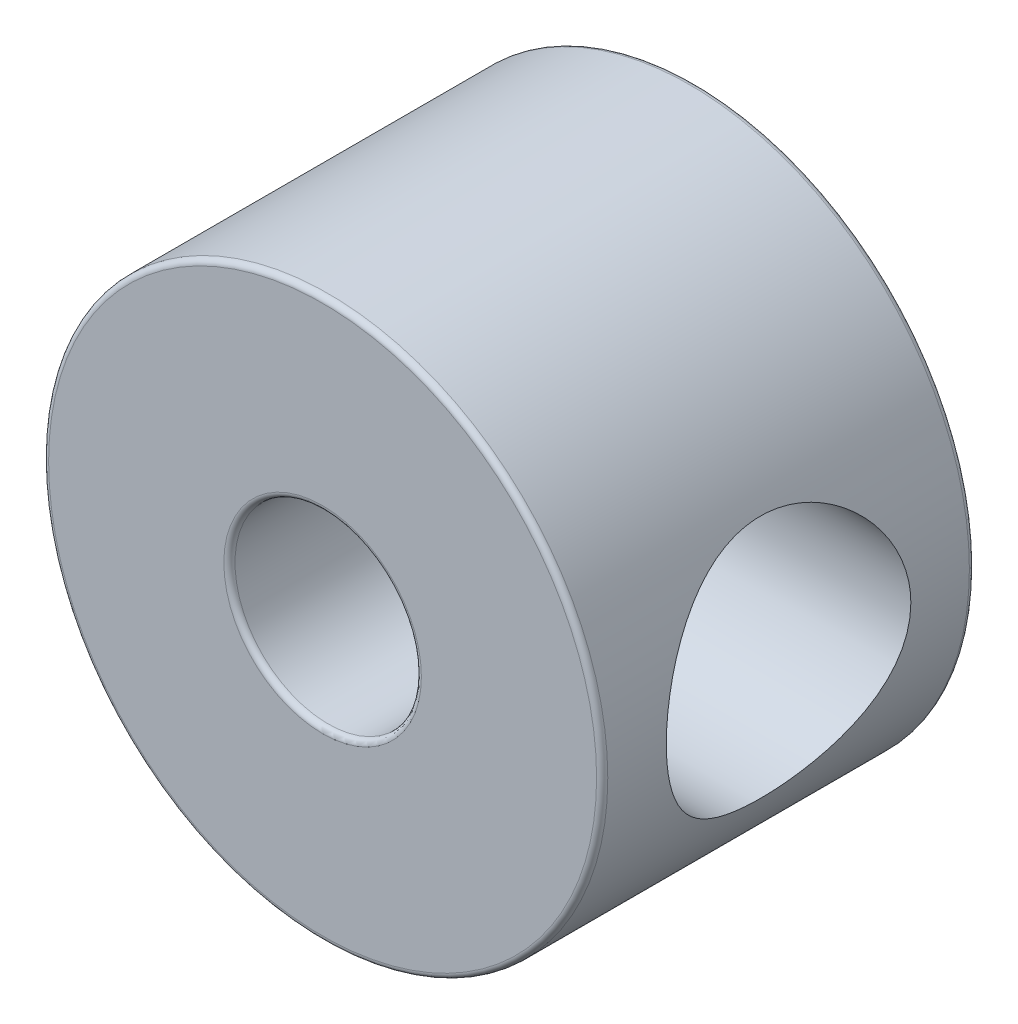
ISO-10303-21;
HEADER;
FILE_DESCRIPTION(('STEP AP214'),'2;1');
FILE_NAME('part.step','',(''),(''),'','','');
FILE_SCHEMA(('AUTOMOTIVE_DESIGN { 1 0 10303 214 1 1 1 1 }'));
ENDSEC;
DATA;
#1=APPLICATION_CONTEXT('core data for automotive mechanical design processes');
#2=APPLICATION_PROTOCOL_DEFINITION('international standard','automotive_design',2000,#1);
#3=PRODUCT_CONTEXT('',#1,'mechanical');
#4=PRODUCT('Part','Part','',(#3));
#5=PRODUCT_RELATED_PRODUCT_CATEGORY('part','',(#4));
#6=PRODUCT_DEFINITION_FORMATION('','',#4);
#7=PRODUCT_DEFINITION_CONTEXT('part definition',#1,'design');
#8=PRODUCT_DEFINITION('design','',#6,#7);
#9=PRODUCT_DEFINITION_SHAPE('','',#8);
#10=(LENGTH_UNIT() NAMED_UNIT(*) SI_UNIT(.MILLI.,.METRE.));
#11=(NAMED_UNIT(*) PLANE_ANGLE_UNIT() SI_UNIT($,.RADIAN.));
#12=(NAMED_UNIT(*) SI_UNIT($,.STERADIAN.) SOLID_ANGLE_UNIT());
#13=UNCERTAINTY_MEASURE_WITH_UNIT(LENGTH_MEASURE(1.E-05),#10,'distance_accuracy_value','');
#14=(GEOMETRIC_REPRESENTATION_CONTEXT(3) GLOBAL_UNCERTAINTY_ASSIGNED_CONTEXT((#13)) GLOBAL_UNIT_ASSIGNED_CONTEXT((#10,
#11,#12)) REPRESENTATION_CONTEXT('',''));
#15=CARTESIAN_POINT('',(0.,0.,0.));
#16=DIRECTION('',(0.,0.,1.));
#17=DIRECTION('',(1.,0.,0.));
#18=AXIS2_PLACEMENT_3D('',#15,#16,#17);
#19=CARTESIAN_POINT('',(1.11022302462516E-13,1.77635683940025E-12,6.35000000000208));
#20=DIRECTION('',(0.,0.,-0.999999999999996));
#21=DIRECTION('',(-1.,0.,0.));
#22=AXIS2_PLACEMENT_3D('',#19,#20,#21);
#23=CYLINDRICAL_SURFACE('',#22,1.58750000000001);
#24=CARTESIAN_POINT('',(-3.33066907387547E-13,8.88178419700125E-13,0.0952500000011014));
#25=DIRECTION('',(0.,0.,0.999999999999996));
#26=DIRECTION('',(1.,0.,0.));
#27=AXIS2_PLACEMENT_3D('',#24,#25,#26);
#28=CIRCLE('',#27,1.58750000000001);
#29=CARTESIAN_POINT('',(1.58749999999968,8.87980140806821E-13,0.0952500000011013));
#30=VERTEX_POINT('',#29);
#31=EDGE_CURVE('E98',#30,#30,#28,.F.);
#32=ORIENTED_EDGE('',*,*,#31,.T.);
#33=EDGE_LOOP('',(#32));
#34=FACE_BOUND('',#33,.T.);
#35=CARTESIAN_POINT('',(-1.11022302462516E-13,-8.88178419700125E-13,6.25475000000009));
#36=DIRECTION('',(0.,0.,0.999999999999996));
#37=DIRECTION('',(1.,0.,0.));
#38=AXIS2_PLACEMENT_3D('',#35,#36,#37);
#39=CIRCLE('',#38,1.58750000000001);
#40=CARTESIAN_POINT('',(1.5874999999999,-8.88376698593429E-13,6.25475000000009));
#41=VERTEX_POINT('',#40);
#42=EDGE_CURVE('E95',#41,#41,#39,.T.);
#43=ORIENTED_EDGE('',*,*,#42,.T.);
#44=EDGE_LOOP('',(#43));
#45=FACE_BOUND('',#44,.T.);
#46=CARTESIAN_POINT('',(-5.55111512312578E-13,-1.58749999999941,4.52329506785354));
#47=CARTESIAN_POINT('',(0.0371796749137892,-1.58751250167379,4.52326321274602));
#48=CARTESIAN_POINT('',(0.0743368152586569,-1.58619448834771,4.52483214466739));
#49=CARTESIAN_POINT('',(0.14814307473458,-1.5810010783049,4.53092016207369));
#50=CARTESIAN_POINT('',(0.184793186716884,-1.577131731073,4.53543226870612));
#51=CARTESIAN_POINT('',(0.256789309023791,-1.56701045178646,4.54707453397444));
#52=CARTESIAN_POINT('',(0.292146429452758,-1.56079296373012,4.55416679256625));
#53=CARTESIAN_POINT('',(0.361866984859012,-1.54611731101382,4.57060020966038));
#54=CARTESIAN_POINT('',(0.396229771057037,-1.53765771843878,4.57994280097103));
#55=CARTESIAN_POINT('',(0.512154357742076,-1.50503567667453,4.61516352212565));
#56=CARTESIAN_POINT('',(0.590930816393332,-1.47571907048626,4.64558051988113));
#57=CARTESIAN_POINT('',(0.741289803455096,-1.40626180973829,4.71214447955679));
#58=CARTESIAN_POINT('',(0.812826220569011,-1.36605712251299,4.74832479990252));
#59=CARTESIAN_POINT('',(0.949831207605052,-1.27471294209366,4.82325226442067));
#60=CARTESIAN_POINT('',(1.01512888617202,-1.22334959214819,4.86203865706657));
#61=CARTESIAN_POINT('',(1.13724834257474,-1.11072352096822,4.9382259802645));
#62=CARTESIAN_POINT('',(1.19408507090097,-1.049478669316,4.97562926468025));
#63=CARTESIAN_POINT('',(1.29617705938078,-0.920098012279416,5.04492936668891));
#64=CARTESIAN_POINT('',(1.34181694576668,-0.852356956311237,5.07699094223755));
#65=CARTESIAN_POINT('',(1.42294443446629,-0.708642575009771,5.13506859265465));
#66=CARTESIAN_POINT('',(1.45843945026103,-0.632675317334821,5.16108907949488));
#67=CARTESIAN_POINT('',(1.51306682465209,-0.48577632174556,5.20157068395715));
#68=CARTESIAN_POINT('',(1.53384789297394,-0.415776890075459,5.2171756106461));
#69=CARTESIAN_POINT('',(1.56567282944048,-0.27240644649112,5.24118501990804));
#70=CARTESIAN_POINT('',(1.57672316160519,-0.199037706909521,5.24959428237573));
#71=CARTESIAN_POINT('',(1.58843334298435,-0.0507808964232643,5.25850793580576));
#72=CARTESIAN_POINT('',(1.58906450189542,0.0241108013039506,5.25899049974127));
#73=CARTESIAN_POINT('',(1.57981967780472,0.172861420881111,5.25194993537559));
#74=CARTESIAN_POINT('',(1.56994201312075,0.246720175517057,5.24442552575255));
#75=CARTESIAN_POINT('',(1.54091140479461,0.38827938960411,5.22249165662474));
#76=CARTESIAN_POINT('',(1.52215233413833,0.45610814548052,5.20837488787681));
#77=CARTESIAN_POINT('',(1.47646448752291,0.587406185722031,5.17440346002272));
#78=CARTESIAN_POINT('',(1.44953370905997,0.650874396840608,5.1545473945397));
#79=CARTESIAN_POINT('',(1.38527569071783,0.778997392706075,5.10796296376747));
#80=CARTESIAN_POINT('',(1.34714863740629,0.843063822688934,5.08072902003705));
#81=CARTESIAN_POINT('',(1.26335095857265,0.964120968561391,5.02244383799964));
#82=CARTESIAN_POINT('',(1.21767534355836,1.02110696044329,4.9913900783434));
#83=CARTESIAN_POINT('',(1.10989755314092,1.13834676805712,4.9207911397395));
#84=CARTESIAN_POINT('',(1.04633627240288,1.19698345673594,4.88078807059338));
#85=CARTESIAN_POINT('',(0.910405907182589,1.30337353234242,4.80094395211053));
#86=CARTESIAN_POINT('',(0.83802511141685,1.3511122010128,4.76110319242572));
#87=CARTESIAN_POINT('',(0.69842674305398,1.42741004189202,4.69246534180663));
#88=CARTESIAN_POINT('',(0.632598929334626,1.45787222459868,4.66296717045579));
#89=CARTESIAN_POINT('',(0.49552149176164,1.50995014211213,4.61008838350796));
#90=CARTESIAN_POINT('',(0.424302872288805,1.53161249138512,4.58667577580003));
#91=CARTESIAN_POINT('',(0.29455780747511,1.56099054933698,4.55403370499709));
#92=CARTESIAN_POINT('',(0.237043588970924,1.57079832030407,4.54275500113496));
#93=CARTESIAN_POINT('',(0.14923668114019,1.58074899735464,4.5312128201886));
#94=CARTESIAN_POINT('',(0.119547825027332,1.58327288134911,4.52826030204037));
#95=CARTESIAN_POINT('',(0.059911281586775,1.58665131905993,4.5242947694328));
#96=CARTESIAN_POINT('',(0.0299633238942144,1.58750384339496,4.52328411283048));
#97=CARTESIAN_POINT('',(0.,1.5875000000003,4.52329506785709));
#98=B_SPLINE_CURVE_WITH_KNOTS('',3,(#46,#47,#48,#49,#50,#51,#52,#53,#54,#55,#56,#57,#58,#59,#60,
#61,#62,#63,#64,#65,#66,#67,#68,#69,#70,#71,#72,#73,#74,#75,#76,#77,#78,#79,#80,#81,#82,#83,#84,
#85,#86,#87,#88,#89,#90,#91,#92,#93,#94,#95,#96,#97),.UNSPECIFIED.,.F.,.F.,(4,2,2,2,2,2,2,2,2,2,
2,2,2,2,2,2,2,2,2,2,2,2,2,2,2,4),(0.,0.111446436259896,0.222629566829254,0.332241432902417,
0.441923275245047,0.708474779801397,0.976629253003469,1.25076368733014,1.52440782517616,
1.78662051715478,2.04864110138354,2.2716794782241,2.49456958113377,2.71807333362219,
2.94161285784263,3.15605417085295,3.37054807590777,3.60779585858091,3.84520109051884,
4.1299808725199,4.41514301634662,4.64933235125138,4.88226443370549,5.05977123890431,
5.14949546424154,5.23932856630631),.UNSPECIFIED.);
#99=CARTESIAN_POINT('',(-5.55111512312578E-13,-1.58749999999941,4.52329506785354));
#100=VERTEX_POINT('',#99);
#101=CARTESIAN_POINT('',(0.,1.5875000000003,4.52329506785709));
#102=VERTEX_POINT('',#101);
#103=EDGE_CURVE('E73',#100,#102,#98,.T.);
#104=ORIENTED_EDGE('',*,*,#103,.F.);
#105=DIRECTION('',(0.,0.,-0.999999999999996));
#106=VECTOR('',#105,1.);
#107=CARTESIAN_POINT('',(1.11022302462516E-13,-1.58750000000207,6.34999999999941));
#108=LINE('',#107,#106);
#109=CARTESIAN_POINT('',(-2.22044604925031E-13,-1.5875000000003,1.82670493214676));
#110=VERTEX_POINT('',#109);
#111=EDGE_CURVE('E77',#100,#110,#108,.T.);
#112=ORIENTED_EDGE('',*,*,#111,.T.);
#113=CARTESIAN_POINT('',(1.11022302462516E-13,1.58749999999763,1.82670493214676));
#114=CARTESIAN_POINT('',(0.0371796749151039,1.58751250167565,1.82673678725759));
#115=CARTESIAN_POINT('',(0.0743368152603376,1.58619448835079,1.82516785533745));
#116=CARTESIAN_POINT('',(0.148143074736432,1.58100107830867,1.81907983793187));
#117=CARTESIAN_POINT('',(0.184793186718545,1.57713173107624,1.81456773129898));
#118=CARTESIAN_POINT('',(0.256789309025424,1.56701045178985,1.80292546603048));
#119=CARTESIAN_POINT('',(0.292146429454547,1.56079296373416,1.79583320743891));
#120=CARTESIAN_POINT('',(0.361866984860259,1.54611731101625,1.77939979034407));
#121=CARTESIAN_POINT('',(0.39622977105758,1.53765771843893,1.77005719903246));
#122=CARTESIAN_POINT('',(0.512154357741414,1.50503567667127,1.73483647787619));
#123=CARTESIAN_POINT('',(0.590930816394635,1.47571907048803,1.70441948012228));
#124=CARTESIAN_POINT('',(0.741289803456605,1.40626180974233,1.63785552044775));
#125=CARTESIAN_POINT('',(0.812826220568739,1.36605712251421,1.60167520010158));
#126=CARTESIAN_POINT('',(0.949831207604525,1.274712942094,1.52674773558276));
#127=CARTESIAN_POINT('',(1.01512888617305,1.22334959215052,1.48796134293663));
#128=CARTESIAN_POINT('',(1.13724834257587,1.110723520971,1.41177401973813));
#129=CARTESIAN_POINT('',(1.19408507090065,1.04947866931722,1.37437073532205));
#130=CARTESIAN_POINT('',(1.29617705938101,0.920098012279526,1.3050706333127));
#131=CARTESIAN_POINT('',(1.34181694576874,0.852356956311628,1.27300905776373));
#132=CARTESIAN_POINT('',(1.42294443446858,0.708642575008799,1.21493140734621));
#133=CARTESIAN_POINT('',(1.45843945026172,0.632675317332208,1.1889109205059));
#134=CARTESIAN_POINT('',(1.51306682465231,0.485776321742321,1.14842931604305));
#135=CARTESIAN_POINT('',(1.53384789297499,0.415776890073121,1.13282438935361));
#136=CARTESIAN_POINT('',(1.56567282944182,0.272406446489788,1.10881498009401));
#137=CARTESIAN_POINT('',(1.57672316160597,0.199037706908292,1.10040571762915));
#138=CARTESIAN_POINT('',(1.58843334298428,0.0507808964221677,1.09149206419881));
#139=CARTESIAN_POINT('',(1.58906450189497,-0.0241108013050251,1.09100950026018));
#140=CARTESIAN_POINT('',(1.5798196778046,-0.172861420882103,1.09805006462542));
#141=CARTESIAN_POINT('',(1.56994201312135,-0.24672017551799,1.10557447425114));
#142=CARTESIAN_POINT('',(1.54091140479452,-0.388279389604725,1.12750834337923));
#143=CARTESIAN_POINT('',(1.52215233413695,-0.456108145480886,1.14162511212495));
#144=CARTESIAN_POINT('',(1.47646448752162,-0.587406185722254,1.17559653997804));
#145=CARTESIAN_POINT('',(1.44953370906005,-0.650874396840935,1.19545260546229));
#146=CARTESIAN_POINT('',(1.38527569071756,-0.778997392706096,1.24203703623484));
#147=CARTESIAN_POINT('',(1.34714863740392,-0.843063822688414,1.26927097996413));
#148=CARTESIAN_POINT('',(1.26335095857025,-0.964120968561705,1.32755616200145));
#149=CARTESIAN_POINT('',(1.21767534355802,-1.021106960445,1.35860992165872));
#150=CARTESIAN_POINT('',(1.10989755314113,-1.1383467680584,1.42920886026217));
#151=CARTESIAN_POINT('',(1.04633627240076,-1.19698345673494,1.46921192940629));
#152=CARTESIAN_POINT('',(0.910405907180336,-1.30337353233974,1.54905604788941));
#153=CARTESIAN_POINT('',(0.838025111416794,-1.35111220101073,1.58889680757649));
#154=CARTESIAN_POINT('',(0.698426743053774,-1.42741004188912,1.65753465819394));
#155=CARTESIAN_POINT('',(0.632598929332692,-1.45787222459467,1.68703282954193));
#156=CARTESIAN_POINT('',(0.495521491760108,-1.50995014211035,1.73991161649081));
#157=CARTESIAN_POINT('',(0.424302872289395,-1.53161249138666,1.76332422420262));
#158=CARTESIAN_POINT('',(0.294557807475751,-1.56099054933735,1.79596629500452));
#159=CARTESIAN_POINT('',(0.237043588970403,-1.57079832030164,1.80724499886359));
#160=CARTESIAN_POINT('',(0.149236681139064,-1.58074899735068,1.81878717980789));
#161=CARTESIAN_POINT('',(0.119547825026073,-1.5832728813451,1.82173969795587));
#162=CARTESIAN_POINT('',(0.0599112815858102,-1.58665131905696,1.82570523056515));
#163=CARTESIAN_POINT('',(0.0299633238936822,-1.5875038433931,1.82671588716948));
#164=CARTESIAN_POINT('',(-2.22044604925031E-13,-1.5875000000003,1.82670493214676));
#165=B_SPLINE_CURVE_WITH_KNOTS('',3,(#113,#114,#115,#116,#117,#118,#119,#120,#121,#122,#123,
#124,#125,#126,#127,#128,#129,#130,#131,#132,#133,#134,#135,#136,#137,#138,#139,#140,#141,#142,
#143,#144,#145,#146,#147,#148,#149,#150,#151,#152,#153,#154,#155,#156,#157,#158,#159,#160,#161,
#162,#163,#164),.UNSPECIFIED.,.F.,.F.,(4,2,2,2,2,2,2,2,2,2,2,2,2,2,2,2,2,2,2,2,2,2,2,2,2,4),(0.,
0.111446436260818,0.222629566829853,0.332241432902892,0.441923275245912,0.708474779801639,
0.976629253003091,1.25076368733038,1.52440782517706,1.78662051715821,2.0486411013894,
2.27167947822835,2.49456958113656,2.71807333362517,2.94161285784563,3.15605417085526,
3.37054807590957,3.60779585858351,3.84520109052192,4.12998087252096,4.41514301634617,
4.64933235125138,4.88226443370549,5.05977123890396,5.14949546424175,5.23932856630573),.UNSPECIFIED.);
#166=CARTESIAN_POINT('',(1.11022302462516E-13,1.58749999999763,1.82670493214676));
#167=VERTEX_POINT('',#166);
#168=EDGE_CURVE('E65',#167,#110,#165,.T.);
#169=ORIENTED_EDGE('',*,*,#168,.F.);
#170=DIRECTION('',(0.,0.,-0.999999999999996));
#171=VECTOR('',#170,1.);
#172=CARTESIAN_POINT('',(3.33066907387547E-13,1.58749999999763,6.35000000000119));
#173=LINE('',#172,#171);
#174=EDGE_CURVE('E56',#167,#102,#173,.F.);
#175=ORIENTED_EDGE('',*,*,#174,.T.);
#176=EDGE_LOOP('',(#104,#112,#169,#175));
#177=FACE_BOUND('',#176,.T.);
#178=ADVANCED_FACE('F38',(#34,#45,#177),#23,.F.);
#179=CARTESIAN_POINT('',(1.11022302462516E-13,1.77635683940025E-12,6.35000000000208));
#180=DIRECTION('',(0.,0.,0.999999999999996));
#181=DIRECTION('',(1.,0.,0.));
#182=AXIS2_PLACEMENT_3D('',#179,#180,#181);
#183=PLANE('',#182);
#184=CARTESIAN_POINT('',(1.11022302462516E-13,1.77635683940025E-12,6.35000000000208));
#185=DIRECTION('',(0.,0.,0.999999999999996));
#186=DIRECTION('',(1.,0.,0.));
#187=AXIS2_PLACEMENT_3D('',#184,#185,#186);
#188=CIRCLE('',#187,1.68275000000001);
#189=CARTESIAN_POINT('',(1.68275000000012,1.77614666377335E-12,6.35000000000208));
#190=VERTEX_POINT('',#189);
#191=EDGE_CURVE('E104',#190,#190,#188,.F.);
#192=ORIENTED_EDGE('',*,*,#191,.T.);
#193=EDGE_LOOP('',(#192));
#194=FACE_BOUND('',#193,.T.);
#195=CARTESIAN_POINT('',(1.11022302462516E-13,1.77635683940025E-12,6.35000000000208));
#196=DIRECTION('',(0.,0.,0.999999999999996));
#197=DIRECTION('',(1.,0.,0.));
#198=AXIS2_PLACEMENT_3D('',#195,#196,#197);
#199=CIRCLE('',#198,4.66725);
#200=CARTESIAN_POINT('',(4.66725000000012,1.77577389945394E-12,6.35000000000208));
#201=VERTEX_POINT('',#200);
#202=EDGE_CURVE('E101',#201,#201,#199,.T.);
#203=ORIENTED_EDGE('',*,*,#202,.T.);
#204=EDGE_LOOP('',(#203));
#205=FACE_BOUND('',#204,.T.);
#206=ADVANCED_FACE('F117',(#194,#205),#183,.T.);
#207=CARTESIAN_POINT('',(0.,0.,0.));
#208=DIRECTION('',(0.,0.,0.999999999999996));
#209=DIRECTION('',(1.,0.,0.));
#210=AXIS2_PLACEMENT_3D('',#207,#208,#209);
#211=PLANE('',#210);
#212=CARTESIAN_POINT('',(0.,0.,0.));
#213=DIRECTION('',(0.,0.,0.999999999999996));
#214=DIRECTION('',(1.,0.,0.));
#215=AXIS2_PLACEMENT_3D('',#212,#213,#214);
#216=CIRCLE('',#215,1.68275000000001);
#217=CARTESIAN_POINT('',(1.68275000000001,0.,0.));
#218=VERTEX_POINT('',#217);
#219=EDGE_CURVE('E83',#218,#218,#216,.T.);
#220=ORIENTED_EDGE('',*,*,#219,.T.);
#221=EDGE_LOOP('',(#220));
#222=FACE_BOUND('',#221,.T.);
#223=CARTESIAN_POINT('',(0.,0.,0.));
#224=DIRECTION('',(0.,0.,0.999999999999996));
#225=DIRECTION('',(1.,0.,0.));
#226=AXIS2_PLACEMENT_3D('',#223,#224,#225);
#227=CIRCLE('',#226,4.66725);
#228=CARTESIAN_POINT('',(4.66725000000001,0.,0.));
#229=VERTEX_POINT('',#228);
#230=EDGE_CURVE('E80',#229,#229,#227,.F.);
#231=ORIENTED_EDGE('',*,*,#230,.T.);
#232=EDGE_LOOP('',(#231));
#233=FACE_BOUND('',#232,.T.);
#234=ADVANCED_FACE('F119',(#222,#233),#211,.F.);
#235=CARTESIAN_POINT('',(1.11022302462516E-13,1.77635683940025E-12,6.35000000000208));
#236=DIRECTION('',(0.,0.,-0.999999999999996));
#237=DIRECTION('',(-1.,0.,0.));
#238=AXIS2_PLACEMENT_3D('',#235,#236,#237);
#239=CYLINDRICAL_SURFACE('',#238,4.7625);
#240=CARTESIAN_POINT('',(-3.33066907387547E-13,8.88178419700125E-13,0.0952500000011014));
#241=DIRECTION('',(0.,0.,0.999999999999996));
#242=DIRECTION('',(1.,0.,0.));
#243=AXIS2_PLACEMENT_3D('',#240,#241,#242);
#244=CIRCLE('',#243,4.7625);
#245=CARTESIAN_POINT('',(4.76249999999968,8.87583583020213E-13,0.095250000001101));
#246=VERTEX_POINT('',#245);
#247=EDGE_CURVE('E11',#246,#246,#244,.T.);
#248=ORIENTED_EDGE('',*,*,#247,.T.);
#249=EDGE_LOOP('',(#248));
#250=FACE_BOUND('',#249,.T.);
#251=CARTESIAN_POINT('',(-1.11022302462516E-13,-8.88178419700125E-13,6.25475000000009));
#252=DIRECTION('',(0.,0.,0.999999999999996));
#253=DIRECTION('',(1.,0.,0.));
#254=AXIS2_PLACEMENT_3D('',#251,#252,#253);
#255=CIRCLE('',#254,4.7625);
#256=CARTESIAN_POINT('',(4.7624999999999,-8.88773256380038E-13,6.25475000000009));
#257=VERTEX_POINT('',#256);
#258=EDGE_CURVE('E46',#257,#257,#255,.F.);
#259=ORIENTED_EDGE('',*,*,#258,.T.);
#260=EDGE_LOOP('',(#259));
#261=FACE_BOUND('',#260,.T.);
#262=CARTESIAN_POINT('',(4.76250000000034,8.88178419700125E-13,1.09220000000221));
#263=CARTESIAN_POINT('',(4.76249603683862,-0.111071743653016,1.0922048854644));
#264=CARTESIAN_POINT('',(4.7585707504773,-0.222321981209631,1.1011371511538));
#265=CARTESIAN_POINT('',(4.74326014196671,-0.441632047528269,1.13651697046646));
#266=CARTESIAN_POINT('',(4.73185647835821,-0.549683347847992,1.16300758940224));
#267=CARTESIAN_POINT('',(4.70280170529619,-0.759075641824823,1.23232764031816));
#268=CARTESIAN_POINT('',(4.68517262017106,-0.860438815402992,1.27509951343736));
#269=CARTESIAN_POINT('',(4.64536073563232,-1.05444297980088,1.37551525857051));
#270=CARTESIAN_POINT('',(4.62317906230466,-1.14708611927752,1.43315545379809));
#271=CARTESIAN_POINT('',(4.57511002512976,-1.32619574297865,1.56496014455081));
#272=CARTESIAN_POINT('',(4.54909352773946,-1.41212894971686,1.6398017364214));
#273=CARTESIAN_POINT('',(4.49681211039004,-1.57069122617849,1.80244876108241));
#274=CARTESIAN_POINT('',(4.47054705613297,-1.64331261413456,1.89026162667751));
#275=CARTESIAN_POINT('',(4.41910049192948,-1.77718548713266,2.08224910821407));
#276=CARTESIAN_POINT('',(4.39405989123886,-1.83758288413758,2.18706109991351));
#277=CARTESIAN_POINT('',(4.34997330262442,-1.9396526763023,2.40660325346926));
#278=CARTESIAN_POINT('',(4.33092392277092,-1.98133567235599,2.52132775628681));
#279=CARTESIAN_POINT('',(4.30238873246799,-2.04253551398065,2.75130313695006));
#280=CARTESIAN_POINT('',(4.29246082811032,-2.06308358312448,2.86622247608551));
#281=CARTESIAN_POINT('',(4.28203712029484,-2.08463987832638,3.0982733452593));
#282=CARTESIAN_POINT('',(4.2815353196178,-2.08566052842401,3.2154034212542));
#283=CARTESIAN_POINT('',(4.28965031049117,-2.06890402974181,3.43776984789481));
#284=CARTESIAN_POINT('',(4.29748584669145,-2.05273752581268,3.54316206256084));
#285=CARTESIAN_POINT('',(4.32006087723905,-2.00478801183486,3.74955203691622));
#286=CARTESIAN_POINT('',(4.33480185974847,-1.97300163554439,3.85054884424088));
#287=CARTESIAN_POINT('',(4.3698670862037,-1.8940856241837,4.04795534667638));
#288=CARTESIAN_POINT('',(4.39030794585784,-1.84663122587,4.14421355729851));
#289=CARTESIAN_POINT('',(4.43444930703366,-1.73795862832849,4.32779938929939));
#290=CARTESIAN_POINT('',(4.45815115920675,-1.67673471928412,4.41512328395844));
#291=CARTESIAN_POINT('',(4.50885047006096,-1.53551529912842,4.58700269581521));
#292=CARTESIAN_POINT('',(4.53594828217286,-1.45429620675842,4.67052632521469));
#293=CARTESIAN_POINT('',(4.58852439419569,-1.27876496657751,4.82313395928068));
#294=CARTESIAN_POINT('',(4.61400223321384,-1.18444911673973,4.89221386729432));
#295=CARTESIAN_POINT('',(4.66135005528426,-0.981993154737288,5.01570142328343));
#296=CARTESIAN_POINT('',(4.68310019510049,-0.873541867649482,5.06964833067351));
#297=CARTESIAN_POINT('',(4.71960237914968,-0.647907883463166,5.15816213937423));
#298=CARTESIAN_POINT('',(4.73435869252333,-0.530730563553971,5.19274086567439));
#299=CARTESIAN_POINT('',(4.75438789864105,-0.299558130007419,5.23928227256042));
#300=CARTESIAN_POINT('',(4.76023920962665,-0.185891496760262,5.25262721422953));
#301=CARTESIAN_POINT('',(4.76367688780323,0.0422002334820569,5.2604937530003));
#302=CARTESIAN_POINT('',(4.76126594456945,0.156625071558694,5.2550214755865));
#303=CARTESIAN_POINT('',(4.7488191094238,0.37623950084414,5.22636058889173));
#304=CARTESIAN_POINT('',(4.73921662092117,0.481587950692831,5.20417857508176));
#305=CARTESIAN_POINT('',(4.71383524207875,0.686930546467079,5.14416956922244));
#306=CARTESIAN_POINT('',(4.69805559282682,0.786924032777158,5.10634065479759));
#307=CARTESIAN_POINT('',(4.66119752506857,0.982261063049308,5.01489504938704));
#308=CARTESIAN_POINT('',(4.63996894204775,1.07736167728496,4.96082197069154));
#309=CARTESIAN_POINT('',(4.59443017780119,1.25748262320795,4.83892084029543));
#310=CARTESIAN_POINT('',(4.5701186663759,1.34249857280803,4.77108684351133));
#311=CARTESIAN_POINT('',(4.51865251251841,1.50704626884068,4.61739782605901));
#312=CARTESIAN_POINT('',(4.49142426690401,1.58562810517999,4.53054792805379));
#313=CARTESIAN_POINT('',(4.4388289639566,1.72740709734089,4.34453050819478));
#314=CARTESIAN_POINT('',(4.41346250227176,1.79059934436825,4.24535907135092));
#315=CARTESIAN_POINT('',(4.36710736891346,1.90090710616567,4.03466919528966));
#316=CARTESIAN_POINT('',(4.34622137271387,1.94765867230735,3.92293587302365));
#317=CARTESIAN_POINT('',(4.31249652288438,2.02124915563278,3.69197284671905));
#318=CARTESIAN_POINT('',(4.29965011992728,2.04810675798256,3.57275029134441));
#319=CARTESIAN_POINT('',(4.28469192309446,2.07920462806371,3.34083228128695));
#320=CARTESIAN_POINT('',(4.28177887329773,2.08513454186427,3.22841452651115));
#321=CARTESIAN_POINT('',(4.28485257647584,2.07881197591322,3.00422807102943));
#322=CARTESIAN_POINT('',(4.29083758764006,2.06656305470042,2.89245924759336));
#323=CARTESIAN_POINT('',(4.31027001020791,2.02569515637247,2.67928372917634));
#324=CARTESIAN_POINT('',(4.32327719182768,1.99803909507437,2.57764822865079));
#325=CARTESIAN_POINT('',(4.35489989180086,1.92813811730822,2.38046245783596));
#326=CARTESIAN_POINT('',(4.37351701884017,1.88588901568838,2.28491394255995));
#327=CARTESIAN_POINT('',(4.41571713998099,1.78494166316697,2.09600788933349));
#328=CARTESIAN_POINT('',(4.43953957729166,1.72537274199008,2.00317025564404));
#329=CARTESIAN_POINT('',(4.48886909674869,1.59263020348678,1.82828257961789));
#330=CARTESIAN_POINT('',(4.51437685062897,1.51945114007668,1.74623687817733));
#331=CARTESIAN_POINT('',(4.56676110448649,1.35432770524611,1.58818661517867));
#332=CARTESIAN_POINT('',(4.59357384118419,1.26132618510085,1.51325994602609));
#333=CARTESIAN_POINT('',(4.64344986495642,1.06311311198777,1.37997779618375));
#334=CARTESIAN_POINT('',(4.66651144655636,0.957896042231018,1.32162984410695));
#335=CARTESIAN_POINT('',(4.7060481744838,0.739382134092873,1.22423130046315));
#336=CARTESIAN_POINT('',(4.72260425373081,0.626206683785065,1.18494205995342));
#337=CARTESIAN_POINT('',(4.74758674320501,0.394140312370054,1.12635570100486));
#338=CARTESIAN_POINT('',(4.75603812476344,0.275268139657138,1.10699716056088));
#339=CARTESIAN_POINT('',(4.76080263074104,0.129794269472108,1.09608454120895));
#340=CARTESIAN_POINT('',(4.76143809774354,0.103863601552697,1.09462913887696));
#341=CARTESIAN_POINT('',(4.76228724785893,0.0519585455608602,1.09268629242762));
#342=CARTESIAN_POINT('',(4.76250092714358,0.0259841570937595,1.09219885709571));
#343=CARTESIAN_POINT('',(4.76250000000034,8.88178419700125E-13,1.09220000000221));
#344=B_SPLINE_CURVE_WITH_KNOTS('',3,(#262,#263,#264,#265,#266,#267,#268,#269,#270,#271,#272,
#273,#274,#275,#276,#277,#278,#279,#280,#281,#282,#283,#284,#285,#286,#287,#288,#289,#290,#291,
#292,#293,#294,#295,#296,#297,#298,#299,#300,#301,#302,#303,#304,#305,#306,#307,#308,#309,#310,
#311,#312,#313,#314,#315,#316,#317,#318,#319,#320,#321,#322,#323,#324,#325,#326,#327,#328,#329,
#330,#331,#332,#333,#334,#335,#336,#337,#338,#339,#340,#341,#342,#343),.UNSPECIFIED.,.T.,.F.,(4,
2,2,2,2,2,2,2,2,2,2,2,2,2,2,2,2,2,2,2,2,2,2,2,2,2,2,2,2,2,2,2,2,2,2,2,2,2,2,2,4),(0.,
0.333108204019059,0.667036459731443,0.999794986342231,1.33247130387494,1.68162667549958,
2.03098290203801,2.3997170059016,2.76824197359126,3.11778335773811,3.46710234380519,
3.7863502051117,4.10566689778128,4.43206803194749,4.75860476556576,5.11583708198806,
5.47317058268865,5.84042760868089,6.20746016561,6.54944714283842,6.89132280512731,
7.21410342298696,7.53692370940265,7.86983121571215,8.20288285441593,8.5619995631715,
8.92123066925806,9.28797626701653,9.65437696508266,9.99041826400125,10.3263937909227,
10.6434074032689,10.96051200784,11.29765297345,11.6349291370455,12.0003920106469,
12.3660205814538,12.7269444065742,13.0867525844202,13.1646793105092,13.2426067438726),.UNSPECIFIED.);
#345=CARTESIAN_POINT('',(4.76250000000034,8.88178419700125E-13,1.09220000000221));
#346=VERTEX_POINT('',#345);
#347=EDGE_CURVE('E78',#346,#346,#344,.T.);
#348=ORIENTED_EDGE('',*,*,#347,.T.);
#349=EDGE_LOOP('',(#348));
#350=FACE_BOUND('',#349,.T.);
#351=ADVANCED_FACE('F109',(#250,#261,#350),#239,.T.);
#352=CARTESIAN_POINT('',(-5.89104801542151,0.,3.17500000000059));
#353=DIRECTION('',(1.,0.,0.));
#354=DIRECTION('',(0.,0.,-0.999999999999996));
#355=AXIS2_PLACEMENT_3D('',#352,#353,#354);
#356=CYLINDRICAL_SURFACE('',#355,2.0828);
#357=ORIENTED_EDGE('',*,*,#103,.T.);
#358=CARTESIAN_POINT('',(1.11022302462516E-13,1.77635683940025E-12,3.17500000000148));
#359=DIRECTION('',(1.,0.,0.));
#360=DIRECTION('',(0.,0.,-0.999999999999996));
#361=AXIS2_PLACEMENT_3D('',#358,#359,#360);
#362=CIRCLE('',#361,2.0828);
#363=EDGE_CURVE('E52',#102,#167,#362,.F.);
#364=ORIENTED_EDGE('',*,*,#363,.T.);
#365=ORIENTED_EDGE('',*,*,#168,.T.);
#366=EDGE_CURVE('E69',#110,#100,#362,.F.);
#367=ORIENTED_EDGE('',*,*,#366,.T.);
#368=EDGE_LOOP('',(#357,#364,#365,#367));
#369=FACE_BOUND('',#368,.T.);
#370=ORIENTED_EDGE('',*,*,#347,.F.);
#371=EDGE_LOOP('',(#370));
#372=FACE_BOUND('',#371,.T.);
#373=ADVANCED_FACE('F67',(#369,#372),#356,.F.);
#374=CARTESIAN_POINT('',(0.,0.,0.));
#375=DIRECTION('',(1.,0.,0.));
#376=DIRECTION('',(0.,0.,-0.999999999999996));
#377=AXIS2_PLACEMENT_3D('',#374,#375,#376);
#378=PLANE('',#377);
#379=ORIENTED_EDGE('',*,*,#366,.F.);
#380=ORIENTED_EDGE('',*,*,#111,.F.);
#381=EDGE_LOOP('',(#379,#380));
#382=FACE_BOUND('',#381,.T.);
#383=ADVANCED_FACE('F76',(#382),#378,.T.);
#384=ORIENTED_EDGE('',*,*,#363,.F.);
#385=ORIENTED_EDGE('',*,*,#174,.F.);
#386=EDGE_LOOP('',(#384,#385));
#387=FACE_BOUND('',#386,.T.);
#388=ADVANCED_FACE('F145',(#387),#378,.T.);
#389=CARTESIAN_POINT('',(-3.33066907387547E-13,8.88178419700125E-13,0.0952500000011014));
#390=DIRECTION('',(0.,0.,0.999999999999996));
#391=DIRECTION('',(1.,0.,0.));
#392=AXIS2_PLACEMENT_3D('',#389,#390,#391);
#393=TOROIDAL_SURFACE('',#392,1.68275000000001,0.09525);
#394=ORIENTED_EDGE('',*,*,#31,.F.);
#395=EDGE_LOOP('',(#394));
#396=FACE_BOUND('',#395,.T.);
#397=ORIENTED_EDGE('',*,*,#219,.F.);
#398=EDGE_LOOP('',(#397));
#399=FACE_BOUND('',#398,.T.);
#400=ADVANCED_FACE('F134',(#396,#399),#393,.T.);
#401=CARTESIAN_POINT('',(-1.11022302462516E-13,-8.88178419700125E-13,6.25475000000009));
#402=DIRECTION('',(0.,0.,0.999999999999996));
#403=DIRECTION('',(1.,0.,0.));
#404=AXIS2_PLACEMENT_3D('',#401,#402,#403);
#405=TOROIDAL_SURFACE('',#404,1.68275000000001,0.09525);
#406=ORIENTED_EDGE('',*,*,#191,.F.);
#407=EDGE_LOOP('',(#406));
#408=FACE_BOUND('',#407,.T.);
#409=ORIENTED_EDGE('',*,*,#42,.F.);
#410=EDGE_LOOP('',(#409));
#411=FACE_BOUND('',#410,.T.);
#412=ADVANCED_FACE('F159',(#408,#411),#405,.T.);
#413=CARTESIAN_POINT('',(-3.33066907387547E-13,8.88178419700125E-13,0.0952500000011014));
#414=DIRECTION('',(0.,0.,0.999999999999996));
#415=DIRECTION('',(1.,0.,0.));
#416=AXIS2_PLACEMENT_3D('',#413,#414,#415);
#417=TOROIDAL_SURFACE('',#416,4.66725,0.09525);
#418=ORIENTED_EDGE('',*,*,#230,.F.);
#419=EDGE_LOOP('',(#418));
#420=FACE_BOUND('',#419,.T.);
#421=ORIENTED_EDGE('',*,*,#247,.F.);
#422=EDGE_LOOP('',(#421));
#423=FACE_BOUND('',#422,.T.);
#424=ADVANCED_FACE('F114',(#420,#423),#417,.T.);
#425=CARTESIAN_POINT('',(-1.11022302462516E-13,-8.88178419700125E-13,6.25475000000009));
#426=DIRECTION('',(0.,0.,0.999999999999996));
#427=DIRECTION('',(1.,0.,0.));
#428=AXIS2_PLACEMENT_3D('',#425,#426,#427);
#429=TOROIDAL_SURFACE('',#428,4.66725,0.09525);
#430=ORIENTED_EDGE('',*,*,#258,.F.);
#431=EDGE_LOOP('',(#430));
#432=FACE_BOUND('',#431,.T.);
#433=ORIENTED_EDGE('',*,*,#202,.F.);
#434=EDGE_LOOP('',(#433));
#435=FACE_BOUND('',#434,.T.);
#436=ADVANCED_FACE('F40',(#432,#435),#429,.T.);
#437=CLOSED_SHELL('',(#178,#206,#234,#351,#373,#383,#388,#400,#412,#424,#436));
#438=MANIFOLD_SOLID_BREP('B2',#437);
#439=ADVANCED_BREP_SHAPE_REPRESENTATION('',(#18,#438),#14);
#440=SHAPE_DEFINITION_REPRESENTATION(#9,#439);
ENDSEC;
END-ISO-10303-21;
